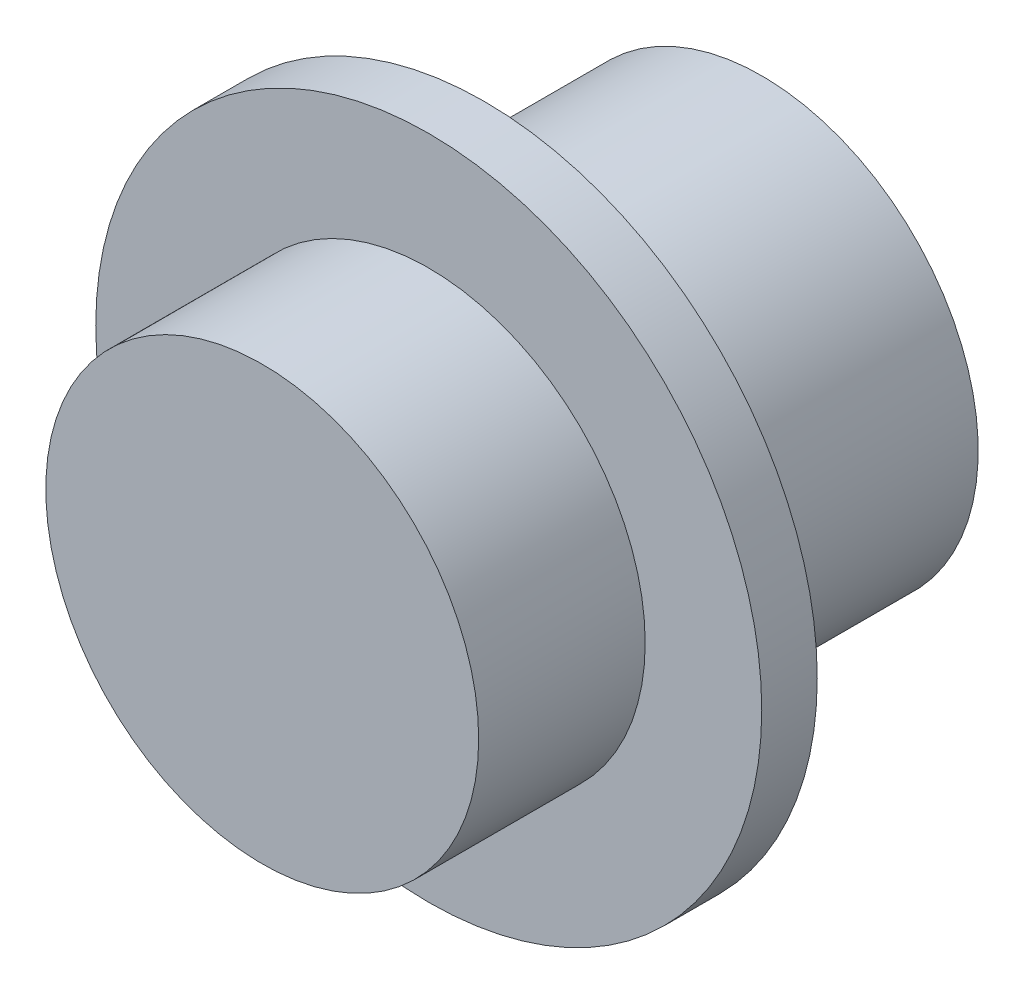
ISO-10303-21;
HEADER;
FILE_DESCRIPTION(('STEP AP214'),'2;1');
FILE_NAME('part.step','',(''),(''),'','','');
FILE_SCHEMA(('AUTOMOTIVE_DESIGN { 1 0 10303 214 1 1 1 1 }'));
ENDSEC;
DATA;
#1=APPLICATION_CONTEXT('core data for automotive mechanical design processes');
#2=APPLICATION_PROTOCOL_DEFINITION('international standard','automotive_design',2000,#1);
#3=PRODUCT_CONTEXT('',#1,'mechanical');
#4=PRODUCT('Part','Part','',(#3));
#5=PRODUCT_RELATED_PRODUCT_CATEGORY('part','',(#4));
#6=PRODUCT_DEFINITION_FORMATION('','',#4);
#7=PRODUCT_DEFINITION_CONTEXT('part definition',#1,'design');
#8=PRODUCT_DEFINITION('design','',#6,#7);
#9=PRODUCT_DEFINITION_SHAPE('','',#8);
#10=(LENGTH_UNIT() NAMED_UNIT(*) SI_UNIT(.MILLI.,.METRE.));
#11=(NAMED_UNIT(*) PLANE_ANGLE_UNIT() SI_UNIT($,.RADIAN.));
#12=(NAMED_UNIT(*) SI_UNIT($,.STERADIAN.) SOLID_ANGLE_UNIT());
#13=UNCERTAINTY_MEASURE_WITH_UNIT(LENGTH_MEASURE(1.E-05),#10,'distance_accuracy_value','');
#14=(GEOMETRIC_REPRESENTATION_CONTEXT(3) GLOBAL_UNCERTAINTY_ASSIGNED_CONTEXT((#13)) GLOBAL_UNIT_ASSIGNED_CONTEXT((#10,
#11,#12)) REPRESENTATION_CONTEXT('',''));
#15=CARTESIAN_POINT('',(0.,0.,0.));
#16=DIRECTION('',(0.,0.,1.));
#17=DIRECTION('',(1.,0.,0.));
#18=AXIS2_PLACEMENT_3D('',#15,#16,#17);
#19=CARTESIAN_POINT('',(0.,0.,4.5));
#20=DIRECTION('',(0.,0.,-1.));
#21=DIRECTION('',(-1.,0.,0.));
#22=AXIS2_PLACEMENT_3D('',#19,#20,#21);
#23=CYLINDRICAL_SURFACE('',#22,3.);
#24=CARTESIAN_POINT('',(0.,0.,3.));
#25=DIRECTION('',(0.,0.,1.));
#26=DIRECTION('',(1.,0.,0.));
#27=AXIS2_PLACEMENT_3D('',#24,#25,#26);
#28=CIRCLE('',#27,3.);
#29=CARTESIAN_POINT('',(3.,0.,3.));
#30=VERTEX_POINT('',#29);
#31=EDGE_CURVE('E11',#30,#30,#28,.T.);
#32=ORIENTED_EDGE('',*,*,#31,.F.);
#33=EDGE_LOOP('',(#32));
#34=FACE_BOUND('',#33,.T.);
#35=CARTESIAN_POINT('',(0.,0.,2.5));
#36=DIRECTION('',(0.,0.,-1.));
#37=DIRECTION('',(-1.,0.,0.));
#38=AXIS2_PLACEMENT_3D('',#35,#36,#37);
#39=CIRCLE('',#38,3.);
#40=CARTESIAN_POINT('',(-3.,0.,2.5));
#41=VERTEX_POINT('',#40);
#42=EDGE_CURVE('E63',#41,#41,#39,.T.);
#43=ORIENTED_EDGE('',*,*,#42,.F.);
#44=EDGE_LOOP('',(#43));
#45=FACE_BOUND('',#44,.T.);
#46=ADVANCED_FACE('F34',(#34,#45),#23,.T.);
#47=CARTESIAN_POINT('',(0.,0.,3.));
#48=DIRECTION('',(0.,0.,1.));
#49=DIRECTION('',(1.,0.,0.));
#50=AXIS2_PLACEMENT_3D('',#47,#48,#49);
#51=PLANE('',#50);
#52=CARTESIAN_POINT('',(0.,0.,3.));
#53=DIRECTION('',(0.,0.,1.));
#54=DIRECTION('',(1.,0.,0.));
#55=AXIS2_PLACEMENT_3D('',#52,#53,#54);
#56=CIRCLE('',#55,1.95);
#57=CARTESIAN_POINT('',(1.95,0.,3.));
#58=VERTEX_POINT('',#57);
#59=EDGE_CURVE('E40',#58,#58,#56,.T.);
#60=ORIENTED_EDGE('',*,*,#59,.F.);
#61=EDGE_LOOP('',(#60));
#62=FACE_BOUND('',#61,.T.);
#63=ORIENTED_EDGE('',*,*,#31,.T.);
#64=EDGE_LOOP('',(#63));
#65=FACE_BOUND('',#64,.T.);
#66=ADVANCED_FACE('F76',(#62,#65),#51,.T.);
#67=CARTESIAN_POINT('',(0.,0.,3.));
#68=DIRECTION('',(0.,0.,1.));
#69=DIRECTION('',(1.,0.,0.));
#70=AXIS2_PLACEMENT_3D('',#67,#68,#69);
#71=CYLINDRICAL_SURFACE('',#70,1.95);
#72=ORIENTED_EDGE('',*,*,#59,.T.);
#73=EDGE_LOOP('',(#72));
#74=FACE_BOUND('',#73,.T.);
#75=CARTESIAN_POINT('',(0.,0.,4.5));
#76=DIRECTION('',(0.,0.,1.));
#77=DIRECTION('',(1.,0.,0.));
#78=AXIS2_PLACEMENT_3D('',#75,#76,#77);
#79=CIRCLE('',#78,1.95);
#80=CARTESIAN_POINT('',(1.95,0.,4.5));
#81=VERTEX_POINT('',#80);
#82=EDGE_CURVE('E67',#81,#81,#79,.T.);
#83=ORIENTED_EDGE('',*,*,#82,.F.);
#84=EDGE_LOOP('',(#83));
#85=FACE_BOUND('',#84,.T.);
#86=ADVANCED_FACE('F74',(#74,#85),#71,.T.);
#87=CARTESIAN_POINT('',(0.,0.,4.5));
#88=DIRECTION('',(0.,0.,1.));
#89=DIRECTION('',(1.,0.,0.));
#90=AXIS2_PLACEMENT_3D('',#87,#88,#89);
#91=PLANE('',#90);
#92=ORIENTED_EDGE('',*,*,#82,.T.);
#93=EDGE_LOOP('',(#92));
#94=FACE_BOUND('',#93,.T.);
#95=ADVANCED_FACE('F72',(#94),#91,.T.);
#96=CARTESIAN_POINT('',(0.,0.,2.5));
#97=DIRECTION('',(0.,0.,-1.));
#98=DIRECTION('',(-1.,0.,0.));
#99=AXIS2_PLACEMENT_3D('',#96,#97,#98);
#100=PLANE('',#99);
#101=CARTESIAN_POINT('',(0.,0.,2.5));
#102=DIRECTION('',(0.,0.,-1.));
#103=DIRECTION('',(-1.,0.,0.));
#104=AXIS2_PLACEMENT_3D('',#101,#102,#103);
#105=CIRCLE('',#104,1.95);
#106=CARTESIAN_POINT('',(-1.95,0.,2.5));
#107=VERTEX_POINT('',#106);
#108=EDGE_CURVE('E57',#107,#107,#105,.T.);
#109=ORIENTED_EDGE('',*,*,#108,.F.);
#110=EDGE_LOOP('',(#109));
#111=FACE_BOUND('',#110,.T.);
#112=ORIENTED_EDGE('',*,*,#42,.T.);
#113=EDGE_LOOP('',(#112));
#114=FACE_BOUND('',#113,.T.);
#115=ADVANCED_FACE('F83',(#111,#114),#100,.T.);
#116=CARTESIAN_POINT('',(0.,0.,2.5));
#117=DIRECTION('',(0.,0.,-1.));
#118=DIRECTION('',(-1.,0.,0.));
#119=AXIS2_PLACEMENT_3D('',#116,#117,#118);
#120=CYLINDRICAL_SURFACE('',#119,1.95);
#121=ORIENTED_EDGE('',*,*,#108,.T.);
#122=EDGE_LOOP('',(#121));
#123=FACE_BOUND('',#122,.T.);
#124=CARTESIAN_POINT('',(0.,0.,0.));
#125=DIRECTION('',(0.,0.,-1.));
#126=DIRECTION('',(-1.,0.,0.));
#127=AXIS2_PLACEMENT_3D('',#124,#125,#126);
#128=CIRCLE('',#127,1.95);
#129=CARTESIAN_POINT('',(-1.95,0.,0.));
#130=VERTEX_POINT('',#129);
#131=EDGE_CURVE('E53',#130,#130,#128,.T.);
#132=ORIENTED_EDGE('',*,*,#131,.F.);
#133=EDGE_LOOP('',(#132));
#134=FACE_BOUND('',#133,.T.);
#135=ADVANCED_FACE('F97',(#123,#134),#120,.T.);
#136=CARTESIAN_POINT('',(0.,0.,0.));
#137=DIRECTION('',(0.,0.,1.));
#138=DIRECTION('',(1.,0.,0.));
#139=AXIS2_PLACEMENT_3D('',#136,#137,#138);
#140=PLANE('',#139);
#141=CARTESIAN_POINT('',(0.,0.,0.));
#142=DIRECTION('',(0.,0.,-1.));
#143=DIRECTION('',(-1.,0.,0.));
#144=AXIS2_PLACEMENT_3D('',#141,#142,#143);
#145=CIRCLE('',#144,0.888999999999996);
#146=CARTESIAN_POINT('',(-0.888999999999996,0.,0.));
#147=VERTEX_POINT('',#146);
#148=EDGE_CURVE('E54',#147,#147,#145,.T.);
#149=ORIENTED_EDGE('',*,*,#148,.F.);
#150=EDGE_LOOP('',(#149));
#151=FACE_BOUND('',#150,.T.);
#152=ORIENTED_EDGE('',*,*,#131,.T.);
#153=EDGE_LOOP('',(#152));
#154=FACE_BOUND('',#153,.T.);
#155=ADVANCED_FACE('F47',(#151,#154),#140,.F.);
#156=CARTESIAN_POINT('',(0.,0.,3.5));
#157=DIRECTION('',(0.,0.,-1.));
#158=DIRECTION('',(-1.,0.,0.));
#159=AXIS2_PLACEMENT_3D('',#156,#157,#158);
#160=CONICAL_SURFACE('',#159,0.888999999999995,1.02974425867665);
#161=CARTESIAN_POINT('',(0.,0.,4.0341650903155));
#162=VERTEX_POINT('',#161);
#163=VERTEX_LOOP('',#162);
#164=FACE_BOUND('',#163,.T.);
#165=CARTESIAN_POINT('',(0.,0.,3.5));
#166=DIRECTION('',(0.,0.,-1.));
#167=DIRECTION('',(-1.,0.,0.));
#168=AXIS2_PLACEMENT_3D('',#165,#166,#167);
#169=CIRCLE('',#168,0.888999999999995);
#170=CARTESIAN_POINT('',(-0.888999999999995,0.,3.5));
#171=VERTEX_POINT('',#170);
#172=EDGE_CURVE('E51',#171,#171,#169,.T.);
#173=ORIENTED_EDGE('',*,*,#172,.T.);
#174=EDGE_LOOP('',(#173));
#175=FACE_BOUND('',#174,.T.);
#176=ADVANCED_FACE('F43',(#164,#175),#160,.F.);
#177=CARTESIAN_POINT('',(0.,0.,0.));
#178=DIRECTION('',(0.,0.,-1.));
#179=DIRECTION('',(-1.,0.,0.));
#180=AXIS2_PLACEMENT_3D('',#177,#178,#179);
#181=CYLINDRICAL_SURFACE('',#180,0.888999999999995);
#182=ORIENTED_EDGE('',*,*,#172,.F.);
#183=EDGE_LOOP('',(#182));
#184=FACE_BOUND('',#183,.T.);
#185=ORIENTED_EDGE('',*,*,#148,.T.);
#186=EDGE_LOOP('',(#185));
#187=FACE_BOUND('',#186,.T.);
#188=ADVANCED_FACE('F46',(#184,#187),#181,.F.);
#189=CLOSED_SHELL('',(#46,#66,#86,#95,#115,#135,#155,#176,#188));
#190=MANIFOLD_SOLID_BREP('B2',#189);
#191=ADVANCED_BREP_SHAPE_REPRESENTATION('',(#18,#190),#14);
#192=SHAPE_DEFINITION_REPRESENTATION(#9,#191);
ENDSEC;
END-ISO-10303-21;
